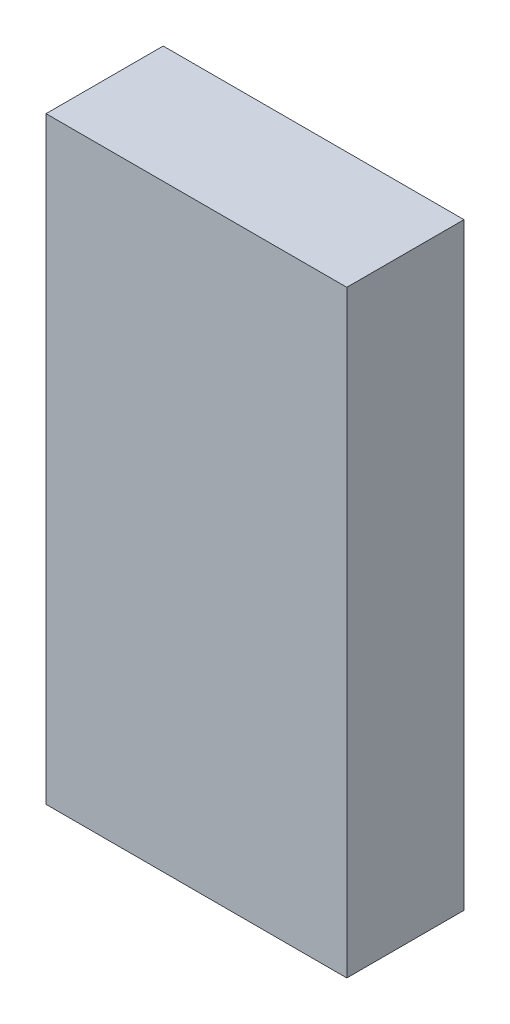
from build123d import *

# Parameters (mm, degrees)
SKETCH1_W           = 778.002
SKETCH1_H           = 391.192
BOSS_EXTRUDE1_DEPTH = 76.2


with BuildPart() as part:
    # Sketch1 → Boss-Extrude1 (new, symmetric)
    with BuildSketch(Plane(origin=(0, 0, 0), x_dir=(0, 1, 0), z_dir=(0, 0, 1))):
        Rectangle(SKETCH1_W, SKETCH1_H)
    extrude(amount=BOSS_EXTRUDE1_DEPTH, both=True)


solid = part.part
